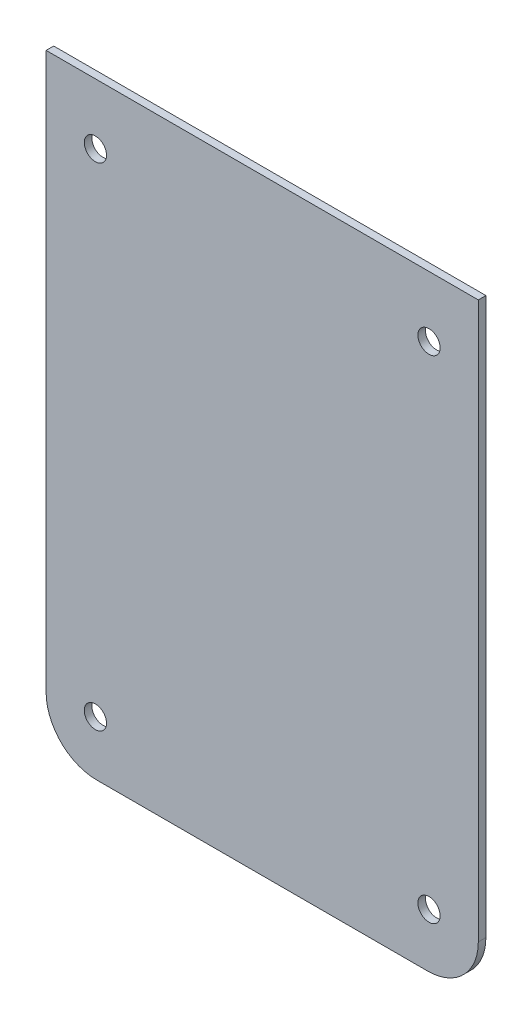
ISO-10303-21;
HEADER;
FILE_DESCRIPTION(('STEP AP214'),'2;1');
FILE_NAME('part.step','',(''),(''),'','','');
FILE_SCHEMA(('AUTOMOTIVE_DESIGN { 1 0 10303 214 1 1 1 1 }'));
ENDSEC;
DATA;
#1=APPLICATION_CONTEXT('core data for automotive mechanical design processes');
#2=APPLICATION_PROTOCOL_DEFINITION('international standard','automotive_design',2000,#1);
#3=PRODUCT_CONTEXT('',#1,'mechanical');
#4=PRODUCT('Part','Part','',(#3));
#5=PRODUCT_RELATED_PRODUCT_CATEGORY('part','',(#4));
#6=PRODUCT_DEFINITION_FORMATION('','',#4);
#7=PRODUCT_DEFINITION_CONTEXT('part definition',#1,'design');
#8=PRODUCT_DEFINITION('design','',#6,#7);
#9=PRODUCT_DEFINITION_SHAPE('','',#8);
#10=(LENGTH_UNIT() NAMED_UNIT(*) SI_UNIT(.MILLI.,.METRE.));
#11=(NAMED_UNIT(*) PLANE_ANGLE_UNIT() SI_UNIT($,.RADIAN.));
#12=(NAMED_UNIT(*) SI_UNIT($,.STERADIAN.) SOLID_ANGLE_UNIT());
#13=UNCERTAINTY_MEASURE_WITH_UNIT(LENGTH_MEASURE(1.E-05),#10,'distance_accuracy_value','');
#14=(GEOMETRIC_REPRESENTATION_CONTEXT(3) GLOBAL_UNCERTAINTY_ASSIGNED_CONTEXT((#13)) GLOBAL_UNIT_ASSIGNED_CONTEXT((#10,
#11,#12)) REPRESENTATION_CONTEXT('',''));
#15=CARTESIAN_POINT('',(0.,0.,0.));
#16=DIRECTION('',(0.,0.,1.));
#17=DIRECTION('',(1.,0.,0.));
#18=AXIS2_PLACEMENT_3D('',#15,#16,#17);
#19=CARTESIAN_POINT('',(-42.75,0.,-1.5));
#20=DIRECTION('',(-1.,0.,0.));
#21=DIRECTION('',(0.,-1.,0.));
#22=AXIS2_PLACEMENT_3D('',#19,#20,#21);
#23=PLANE('',#22);
#24=DIRECTION('',(0.,-1.,0.));
#25=VECTOR('',#24,1.);
#26=CARTESIAN_POINT('',(-42.75,0.,-1.5));
#27=LINE('',#26,#25);
#28=CARTESIAN_POINT('',(-42.75,120.,-1.5));
#29=VERTEX_POINT('',#28);
#30=CARTESIAN_POINT('',(-42.75,10.,-1.5));
#31=VERTEX_POINT('',#30);
#32=EDGE_CURVE('E104',#29,#31,#27,.T.);
#33=ORIENTED_EDGE('',*,*,#32,.T.);
#34=DIRECTION('',(0.,0.,1.));
#35=VECTOR('',#34,1.);
#36=CARTESIAN_POINT('',(-42.75,10.,-1.5));
#37=LINE('',#36,#35);
#38=CARTESIAN_POINT('',(-42.75,10.,0.));
#39=VERTEX_POINT('',#38);
#40=EDGE_CURVE('E11',#31,#39,#37,.T.);
#41=ORIENTED_EDGE('',*,*,#40,.T.);
#42=DIRECTION('',(0.,-1.,0.));
#43=VECTOR('',#42,1.);
#44=CARTESIAN_POINT('',(-42.75,0.,0.));
#45=LINE('',#44,#43);
#46=CARTESIAN_POINT('',(-42.75,120.,0.));
#47=VERTEX_POINT('',#46);
#48=EDGE_CURVE('E108',#47,#39,#45,.T.);
#49=ORIENTED_EDGE('',*,*,#48,.F.);
#50=DIRECTION('',(0.,0.,1.));
#51=VECTOR('',#50,1.);
#52=CARTESIAN_POINT('',(-42.75,120.,-1.5));
#53=LINE('',#52,#51);
#54=EDGE_CURVE('E101',#29,#47,#53,.T.);
#55=ORIENTED_EDGE('',*,*,#54,.F.);
#56=EDGE_LOOP('',(#33,#41,#49,#55));
#57=FACE_BOUND('',#56,.T.);
#58=ADVANCED_FACE('F32',(#57),#23,.T.);
#59=CARTESIAN_POINT('',(-42.75,120.,-1.5));
#60=DIRECTION('',(0.,1.,0.));
#61=DIRECTION('',(0.,0.,1.));
#62=AXIS2_PLACEMENT_3D('',#59,#60,#61);
#63=PLANE('',#62);
#64=DIRECTION('',(-1.,0.,0.));
#65=VECTOR('',#64,1.);
#66=CARTESIAN_POINT('',(-42.75,120.,0.));
#67=LINE('',#66,#65);
#68=CARTESIAN_POINT('',(42.75,120.,0.));
#69=VERTEX_POINT('',#68);
#70=EDGE_CURVE('E100',#69,#47,#67,.T.);
#71=ORIENTED_EDGE('',*,*,#70,.F.);
#72=DIRECTION('',(0.,0.,1.));
#73=VECTOR('',#72,1.);
#74=CARTESIAN_POINT('',(42.75,120.,-1.5));
#75=LINE('',#74,#73);
#76=CARTESIAN_POINT('',(42.75,120.,-1.5));
#77=VERTEX_POINT('',#76);
#78=EDGE_CURVE('E89',#77,#69,#75,.T.);
#79=ORIENTED_EDGE('',*,*,#78,.F.);
#80=DIRECTION('',(-1.,0.,0.));
#81=VECTOR('',#80,1.);
#82=CARTESIAN_POINT('',(-42.75,120.,-1.5));
#83=LINE('',#82,#81);
#84=EDGE_CURVE('E93',#77,#29,#83,.T.);
#85=ORIENTED_EDGE('',*,*,#84,.T.);
#86=ORIENTED_EDGE('',*,*,#54,.T.);
#87=EDGE_LOOP('',(#71,#79,#85,#86));
#88=FACE_BOUND('',#87,.T.);
#89=ADVANCED_FACE('F98',(#88),#63,.T.);
#90=CARTESIAN_POINT('',(42.75,0.,-1.5));
#91=DIRECTION('',(1.,0.,0.));
#92=DIRECTION('',(0.,0.,-1.));
#93=AXIS2_PLACEMENT_3D('',#90,#91,#92);
#94=PLANE('',#93);
#95=DIRECTION('',(0.,1.,0.));
#96=VECTOR('',#95,1.);
#97=CARTESIAN_POINT('',(42.75,0.,0.));
#98=LINE('',#97,#96);
#99=CARTESIAN_POINT('',(42.75,10.,0.));
#100=VERTEX_POINT('',#99);
#101=EDGE_CURVE('E115',#100,#69,#98,.T.);
#102=ORIENTED_EDGE('',*,*,#101,.F.);
#103=DIRECTION('',(0.,0.,1.));
#104=VECTOR('',#103,1.);
#105=CARTESIAN_POINT('',(42.75,10.,-1.5));
#106=LINE('',#105,#104);
#107=CARTESIAN_POINT('',(42.75,10.,-1.5));
#108=VERTEX_POINT('',#107);
#109=EDGE_CURVE('E55',#100,#108,#106,.F.);
#110=ORIENTED_EDGE('',*,*,#109,.T.);
#111=DIRECTION('',(0.,1.,0.));
#112=VECTOR('',#111,1.);
#113=CARTESIAN_POINT('',(42.75,0.,-1.5));
#114=LINE('',#113,#112);
#115=EDGE_CURVE('E86',#108,#77,#114,.T.);
#116=ORIENTED_EDGE('',*,*,#115,.T.);
#117=ORIENTED_EDGE('',*,*,#78,.T.);
#118=EDGE_LOOP('',(#102,#110,#116,#117));
#119=FACE_BOUND('',#118,.T.);
#120=ADVANCED_FACE('F88',(#119),#94,.T.);
#121=CARTESIAN_POINT('',(-42.75,0.,-1.5));
#122=DIRECTION('',(0.,-1.,0.));
#123=DIRECTION('',(0.,0.,-1.));
#124=AXIS2_PLACEMENT_3D('',#121,#122,#123);
#125=PLANE('',#124);
#126=DIRECTION('',(1.,0.,0.));
#127=VECTOR('',#126,1.);
#128=CARTESIAN_POINT('',(-42.75,0.,-1.5));
#129=LINE('',#128,#127);
#130=CARTESIAN_POINT('',(-32.75,0.,-1.5));
#131=VERTEX_POINT('',#130);
#132=CARTESIAN_POINT('',(32.75,0.,-1.5));
#133=VERTEX_POINT('',#132);
#134=EDGE_CURVE('E94',#131,#133,#129,.T.);
#135=ORIENTED_EDGE('',*,*,#134,.T.);
#136=DIRECTION('',(0.,0.,1.));
#137=VECTOR('',#136,1.);
#138=CARTESIAN_POINT('',(32.75,0.,-1.5));
#139=LINE('',#138,#137);
#140=CARTESIAN_POINT('',(32.75,0.,0.));
#141=VERTEX_POINT('',#140);
#142=EDGE_CURVE('E121',#133,#141,#139,.T.);
#143=ORIENTED_EDGE('',*,*,#142,.T.);
#144=DIRECTION('',(1.,0.,0.));
#145=VECTOR('',#144,1.);
#146=CARTESIAN_POINT('',(-42.75,0.,0.));
#147=LINE('',#146,#145);
#148=CARTESIAN_POINT('',(-32.75,0.,0.));
#149=VERTEX_POINT('',#148);
#150=EDGE_CURVE('E111',#149,#141,#147,.T.);
#151=ORIENTED_EDGE('',*,*,#150,.F.);
#152=DIRECTION('',(0.,0.,1.));
#153=VECTOR('',#152,1.);
#154=CARTESIAN_POINT('',(-32.75,0.,-1.5));
#155=LINE('',#154,#153);
#156=EDGE_CURVE('E118',#149,#131,#155,.F.);
#157=ORIENTED_EDGE('',*,*,#156,.T.);
#158=EDGE_LOOP('',(#135,#143,#151,#157));
#159=FACE_BOUND('',#158,.T.);
#160=ADVANCED_FACE('F133',(#159),#125,.T.);
#161=CARTESIAN_POINT('',(-42.75,120.,-1.5));
#162=DIRECTION('',(0.,0.,-1.));
#163=DIRECTION('',(-1.,0.,0.));
#164=AXIS2_PLACEMENT_3D('',#161,#162,#163);
#165=PLANE('',#164);
#166=CARTESIAN_POINT('',(33.,10.7,-1.5));
#167=DIRECTION('',(0.,0.,1.));
#168=DIRECTION('',(1.,0.,0.));
#169=AXIS2_PLACEMENT_3D('',#166,#167,#168);
#170=CIRCLE('',#169,2.2);
#171=CARTESIAN_POINT('',(35.2,10.7,-1.5));
#172=VERTEX_POINT('',#171);
#173=EDGE_CURVE('E160',#172,#172,#170,.T.);
#174=ORIENTED_EDGE('',*,*,#173,.T.);
#175=EDGE_LOOP('',(#174));
#176=FACE_BOUND('',#175,.T.);
#177=CARTESIAN_POINT('',(-33.,10.7,-1.5));
#178=DIRECTION('',(0.,0.,1.));
#179=DIRECTION('',(1.,0.,0.));
#180=AXIS2_PLACEMENT_3D('',#177,#178,#179);
#181=CIRCLE('',#180,2.2);
#182=CARTESIAN_POINT('',(-30.8,10.7,-1.5));
#183=VERTEX_POINT('',#182);
#184=EDGE_CURVE('E154',#183,#183,#181,.T.);
#185=ORIENTED_EDGE('',*,*,#184,.T.);
#186=EDGE_LOOP('',(#185));
#187=FACE_BOUND('',#186,.T.);
#188=CARTESIAN_POINT('',(33.,108.,-1.5));
#189=DIRECTION('',(0.,0.,1.));
#190=DIRECTION('',(1.,0.,0.));
#191=AXIS2_PLACEMENT_3D('',#188,#189,#190);
#192=CIRCLE('',#191,2.19999999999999);
#193=CARTESIAN_POINT('',(35.2,108.,-1.5));
#194=VERTEX_POINT('',#193);
#195=EDGE_CURVE('E148',#194,#194,#192,.T.);
#196=ORIENTED_EDGE('',*,*,#195,.T.);
#197=EDGE_LOOP('',(#196));
#198=FACE_BOUND('',#197,.T.);
#199=CARTESIAN_POINT('',(-33.,108.,-1.5));
#200=DIRECTION('',(0.,0.,1.));
#201=DIRECTION('',(1.,0.,0.));
#202=AXIS2_PLACEMENT_3D('',#199,#200,#201);
#203=CIRCLE('',#202,2.2);
#204=CARTESIAN_POINT('',(-30.8,108.,-1.5));
#205=VERTEX_POINT('',#204);
#206=EDGE_CURVE('E112',#205,#205,#203,.T.);
#207=ORIENTED_EDGE('',*,*,#206,.T.);
#208=EDGE_LOOP('',(#207));
#209=FACE_BOUND('',#208,.T.);
#210=ORIENTED_EDGE('',*,*,#115,.F.);
#211=CARTESIAN_POINT('',(32.75,10.,-1.5));
#212=DIRECTION('',(0.,0.,-1.));
#213=DIRECTION('',(-1.,0.,0.));
#214=AXIS2_PLACEMENT_3D('',#211,#212,#213);
#215=CIRCLE('',#214,10.);
#216=EDGE_CURVE('E40',#108,#133,#215,.T.);
#217=ORIENTED_EDGE('',*,*,#216,.T.);
#218=ORIENTED_EDGE('',*,*,#134,.F.);
#219=CARTESIAN_POINT('',(-32.75,10.,-1.5));
#220=DIRECTION('',(0.,0.,-1.));
#221=DIRECTION('',(-1.,0.,0.));
#222=AXIS2_PLACEMENT_3D('',#219,#220,#221);
#223=CIRCLE('',#222,10.);
#224=EDGE_CURVE('E47',#131,#31,#223,.T.);
#225=ORIENTED_EDGE('',*,*,#224,.T.);
#226=ORIENTED_EDGE('',*,*,#32,.F.);
#227=ORIENTED_EDGE('',*,*,#84,.F.);
#228=EDGE_LOOP('',(#210,#217,#218,#225,#226,#227));
#229=FACE_BOUND('',#228,.T.);
#230=ADVANCED_FACE('F103',(#176,#187,#198,#209,#229),#165,.T.);
#231=CARTESIAN_POINT('',(-42.75,120.,0.));
#232=DIRECTION('',(0.,0.,-1.));
#233=DIRECTION('',(-1.,0.,0.));
#234=AXIS2_PLACEMENT_3D('',#231,#232,#233);
#235=PLANE('',#234);
#236=CARTESIAN_POINT('',(33.,10.7,0.));
#237=DIRECTION('',(0.,0.,1.));
#238=DIRECTION('',(1.,0.,0.));
#239=AXIS2_PLACEMENT_3D('',#236,#237,#238);
#240=CIRCLE('',#239,2.2);
#241=CARTESIAN_POINT('',(35.2,10.7,0.));
#242=VERTEX_POINT('',#241);
#243=EDGE_CURVE('E163',#242,#242,#240,.T.);
#244=ORIENTED_EDGE('',*,*,#243,.F.);
#245=EDGE_LOOP('',(#244));
#246=FACE_BOUND('',#245,.T.);
#247=CARTESIAN_POINT('',(-33.,10.7,0.));
#248=DIRECTION('',(0.,0.,1.));
#249=DIRECTION('',(1.,0.,0.));
#250=AXIS2_PLACEMENT_3D('',#247,#248,#249);
#251=CIRCLE('',#250,2.2);
#252=CARTESIAN_POINT('',(-30.8,10.7,0.));
#253=VERTEX_POINT('',#252);
#254=EDGE_CURVE('E157',#253,#253,#251,.T.);
#255=ORIENTED_EDGE('',*,*,#254,.F.);
#256=EDGE_LOOP('',(#255));
#257=FACE_BOUND('',#256,.T.);
#258=CARTESIAN_POINT('',(33.,108.,0.));
#259=DIRECTION('',(0.,0.,1.));
#260=DIRECTION('',(1.,0.,0.));
#261=AXIS2_PLACEMENT_3D('',#258,#259,#260);
#262=CIRCLE('',#261,2.19999999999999);
#263=CARTESIAN_POINT('',(35.2,108.,0.));
#264=VERTEX_POINT('',#263);
#265=EDGE_CURVE('E151',#264,#264,#262,.T.);
#266=ORIENTED_EDGE('',*,*,#265,.F.);
#267=EDGE_LOOP('',(#266));
#268=FACE_BOUND('',#267,.T.);
#269=CARTESIAN_POINT('',(-33.,108.,0.));
#270=DIRECTION('',(0.,0.,1.));
#271=DIRECTION('',(1.,0.,0.));
#272=AXIS2_PLACEMENT_3D('',#269,#270,#271);
#273=CIRCLE('',#272,2.2);
#274=CARTESIAN_POINT('',(-30.8,108.,0.));
#275=VERTEX_POINT('',#274);
#276=EDGE_CURVE('E145',#275,#275,#273,.T.);
#277=ORIENTED_EDGE('',*,*,#276,.F.);
#278=EDGE_LOOP('',(#277));
#279=FACE_BOUND('',#278,.T.);
#280=ORIENTED_EDGE('',*,*,#150,.T.);
#281=CARTESIAN_POINT('',(32.75,10.,0.));
#282=DIRECTION('',(0.,0.,-1.));
#283=DIRECTION('',(-1.,0.,0.));
#284=AXIS2_PLACEMENT_3D('',#281,#282,#283);
#285=CIRCLE('',#284,10.);
#286=EDGE_CURVE('E126',#141,#100,#285,.F.);
#287=ORIENTED_EDGE('',*,*,#286,.T.);
#288=ORIENTED_EDGE('',*,*,#101,.T.);
#289=ORIENTED_EDGE('',*,*,#70,.T.);
#290=ORIENTED_EDGE('',*,*,#48,.T.);
#291=CARTESIAN_POINT('',(-32.75,10.,0.));
#292=DIRECTION('',(0.,0.,-1.));
#293=DIRECTION('',(-1.,0.,0.));
#294=AXIS2_PLACEMENT_3D('',#291,#292,#293);
#295=CIRCLE('',#294,10.);
#296=EDGE_CURVE('E124',#39,#149,#295,.F.);
#297=ORIENTED_EDGE('',*,*,#296,.T.);
#298=EDGE_LOOP('',(#280,#287,#288,#289,#290,#297));
#299=FACE_BOUND('',#298,.T.);
#300=ADVANCED_FACE('F138',(#246,#257,#268,#279,#299),#235,.F.);
#301=CARTESIAN_POINT('',(32.75,10.,-1.5));
#302=DIRECTION('',(0.,0.,1.));
#303=DIRECTION('',(1.,0.,0.));
#304=AXIS2_PLACEMENT_3D('',#301,#302,#303);
#305=CYLINDRICAL_SURFACE('',#304,10.);
#306=ORIENTED_EDGE('',*,*,#216,.F.);
#307=ORIENTED_EDGE('',*,*,#109,.F.);
#308=ORIENTED_EDGE('',*,*,#286,.F.);
#309=ORIENTED_EDGE('',*,*,#142,.F.);
#310=EDGE_LOOP('',(#306,#307,#308,#309));
#311=FACE_BOUND('',#310,.T.);
#312=ADVANCED_FACE('F136',(#311),#305,.T.);
#313=CARTESIAN_POINT('',(-32.75,10.,-1.5));
#314=DIRECTION('',(0.,0.,1.));
#315=DIRECTION('',(1.,0.,0.));
#316=AXIS2_PLACEMENT_3D('',#313,#314,#315);
#317=CYLINDRICAL_SURFACE('',#316,10.);
#318=ORIENTED_EDGE('',*,*,#224,.F.);
#319=ORIENTED_EDGE('',*,*,#156,.F.);
#320=ORIENTED_EDGE('',*,*,#296,.F.);
#321=ORIENTED_EDGE('',*,*,#40,.F.);
#322=EDGE_LOOP('',(#318,#319,#320,#321));
#323=FACE_BOUND('',#322,.T.);
#324=ADVANCED_FACE('F34',(#323),#317,.T.);
#325=CARTESIAN_POINT('',(-33.,108.,-1.5));
#326=DIRECTION('',(0.,0.,1.));
#327=DIRECTION('',(1.,0.,0.));
#328=AXIS2_PLACEMENT_3D('',#325,#326,#327);
#329=CYLINDRICAL_SURFACE('',#328,2.2);
#330=ORIENTED_EDGE('',*,*,#206,.F.);
#331=EDGE_LOOP('',(#330));
#332=FACE_BOUND('',#331,.T.);
#333=ORIENTED_EDGE('',*,*,#276,.T.);
#334=EDGE_LOOP('',(#333));
#335=FACE_BOUND('',#334,.T.);
#336=ADVANCED_FACE('F187',(#332,#335),#329,.F.);
#337=CARTESIAN_POINT('',(33.,108.,-1.5));
#338=DIRECTION('',(0.,0.,1.));
#339=DIRECTION('',(1.,0.,0.));
#340=AXIS2_PLACEMENT_3D('',#337,#338,#339);
#341=CYLINDRICAL_SURFACE('',#340,2.19999999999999);
#342=ORIENTED_EDGE('',*,*,#195,.F.);
#343=EDGE_LOOP('',(#342));
#344=FACE_BOUND('',#343,.T.);
#345=ORIENTED_EDGE('',*,*,#265,.T.);
#346=EDGE_LOOP('',(#345));
#347=FACE_BOUND('',#346,.T.);
#348=ADVANCED_FACE('F189',(#344,#347),#341,.F.);
#349=CARTESIAN_POINT('',(-33.,10.7,-1.5));
#350=DIRECTION('',(0.,0.,1.));
#351=DIRECTION('',(1.,0.,0.));
#352=AXIS2_PLACEMENT_3D('',#349,#350,#351);
#353=CYLINDRICAL_SURFACE('',#352,2.2);
#354=ORIENTED_EDGE('',*,*,#184,.F.);
#355=EDGE_LOOP('',(#354));
#356=FACE_BOUND('',#355,.T.);
#357=ORIENTED_EDGE('',*,*,#254,.T.);
#358=EDGE_LOOP('',(#357));
#359=FACE_BOUND('',#358,.T.);
#360=ADVANCED_FACE('F174',(#356,#359),#353,.F.);
#361=CARTESIAN_POINT('',(33.,10.7,-1.5));
#362=DIRECTION('',(0.,0.,1.));
#363=DIRECTION('',(1.,0.,0.));
#364=AXIS2_PLACEMENT_3D('',#361,#362,#363);
#365=CYLINDRICAL_SURFACE('',#364,2.2);
#366=ORIENTED_EDGE('',*,*,#173,.F.);
#367=EDGE_LOOP('',(#366));
#368=FACE_BOUND('',#367,.T.);
#369=ORIENTED_EDGE('',*,*,#243,.T.);
#370=EDGE_LOOP('',(#369));
#371=FACE_BOUND('',#370,.T.);
#372=ADVANCED_FACE('F171',(#368,#371),#365,.F.);
#373=CLOSED_SHELL('',(#58,#89,#120,#160,#230,#300,#312,#324,#336,#348,#360,#372));
#374=MANIFOLD_SOLID_BREP('B2',#373);
#375=ADVANCED_BREP_SHAPE_REPRESENTATION('',(#18,#374),#14);
#376=SHAPE_DEFINITION_REPRESENTATION(#9,#375);
ENDSEC;
END-ISO-10303-21;
